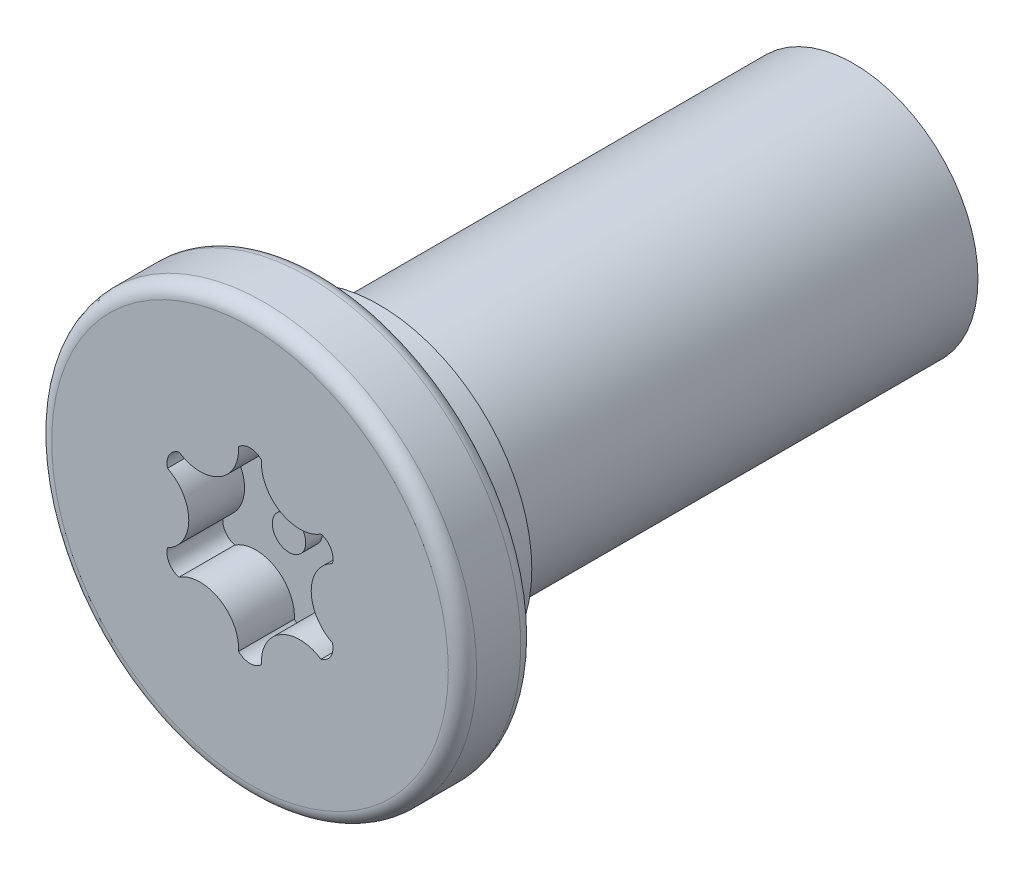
from build123d import *

# Parameters (mm, degrees)
SKETCH2_W           = 1.3
SKETCH2_H           = 3.81
SKETCH2_W_2         = 12.7
SKETCH2_H_2         = 2.23
CUT_EXTRUDE3_DEPTH  = 1
FILLET12_R          = 0.254
CUT_EXTRUDE6_START  = -12.7
SKETCH7_R           = 2.23
CUT_EXTRUDE6_DEPTH  = 12.7
SKETCH11_R          = 2.738000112
SKETCH11_R_2        = 2.230000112
BOSS_EXTRUDE1_DEPTH = 1.016
SKETCH12_R          = 2.230000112
BOSS_EXTRUDE2_DEPTH = 12.7
SKETCH14_R          = 0.3
BOSS_EXTRUDE4_DEPTH = 0.3
CUT_EXTRUDE7_START  = -12.7
SKETCH15_R          = 2.230000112
CUT_EXTRUDE7_DEPTH  = 12.7
SKETCH16_R          = 2.230000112
BOSS_EXTRUDE5_DEPTH = 9.525


with BuildPart() as part:
    # Sketch2 → Revolve1 (revolve)
    with BuildSketch(Plane(origin=(0, 0, 0), x_dir=(0, 0, -1), z_dir=(1, 0, 0)), mode=Mode.PRIVATE) as revolve1_sk:
        with Locations((0.65, 1.905)):
            Rectangle(SKETCH2_W, SKETCH2_H)
        with Locations((7.65, 1.115)):
            Rectangle(SKETCH2_W_2, SKETCH2_H_2)
    revolve(revolve1_sk.sketch.rotate(Axis((0, 0, -1.3), (0, 0, -1)), 90), axis=Axis((0, 0, -1.3), (0, 0, -1)))

    # Sketch3 → Cut-Extrude3 (cut)
    with BuildSketch(Plane.XY):
        with BuildLine():
            ThreePointArc((-0.205060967, 1.589373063), (0, 1.674312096), (0.205060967, 1.589373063))
            ThreePointArc((0.205060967, 1.589373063), (0.54882888, 0.950599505), (1.273906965, 0.972274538))
            ThreePointArc((1.273906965, 0.972274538), (1.449996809, 0.837156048), (1.478967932, 0.617098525))
            ThreePointArc((1.478967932, 0.617098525), (1.097657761, 0), (1.478967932, -0.617098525))
            ThreePointArc((1.478967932, -0.617098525), (1.449996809, -0.837156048), (1.273906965, -0.972274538))
            ThreePointArc((1.273906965, -0.972274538), (0.54882888, -0.950599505), (0.205060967, -1.589373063))
            ThreePointArc((0.205060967, -1.589373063), (0, -1.674312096), (-0.205060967, -1.589373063))
            ThreePointArc((-0.205060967, -1.589373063), (-0.54882888, -0.950599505), (-1.273906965, -0.972274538))
            ThreePointArc((-1.273906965, -0.972274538), (-1.449996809, -0.837156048), (-1.478967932, -0.617098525))
            ThreePointArc((-1.478967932, -0.617098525), (-1.097657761, 0), (-1.478967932, 0.617098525))
            ThreePointArc((-1.478967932, 0.617098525), (-1.449996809, 0.837156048), (-1.273906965, 0.972274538))
            ThreePointArc((-1.273906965, 0.972274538), (-0.54882888, 0.950599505), (-0.205060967, 1.589373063))
        make_face()
    extrude(amount=-CUT_EXTRUDE3_DEPTH, mode=Mode.SUBTRACT)

    # Fillet12
    fillet12_edges = [part.edges().sort_by_distance(p)[0] for p in [
        (-3.81, 0, 0),
        (-3.81, 0, -1.3),
    ]]
    fillet(fillet12_edges, radius=FILLET12_R)

    # Sketch7 → Cut-Extrude6 (cut)
    with BuildSketch(Plane(origin=(0, 0, -14), x_dir=(-1, 0, 0), z_dir=(0, 0, -1)).offset(CUT_EXTRUDE6_START)):
        Circle(SKETCH7_R)
    extrude(amount=CUT_EXTRUDE6_DEPTH, mode=Mode.SUBTRACT)

    # Sketch11 → Boss-Extrude1 (add)
    with BuildSketch(Plane(origin=(0, 0, -1.3), x_dir=(-1, 0, 0), z_dir=(0, 0, -1))):
        with Locations(Location((0, 0, 0), (0, 0, 180))):
            Circle(SKETCH11_R)
        Circle(SKETCH11_R_2, mode=Mode.SUBTRACT)
    extrude(amount=BOSS_EXTRUDE1_DEPTH)

    # Sketch12 → Boss-Extrude2 (add)
    with BuildSketch(Plane(origin=(0, 0, -1.3), x_dir=(-1, 0, 0), z_dir=(0, 0, -1))):
        Circle(SKETCH12_R)
    extrude(amount=BOSS_EXTRUDE2_DEPTH)

    # Sketch14 → Boss-Extrude4 (add)
    with BuildSketch(Plane.XY.offset(-1)):
        Circle(SKETCH14_R)
    extrude(amount=BOSS_EXTRUDE4_DEPTH)

    # Sketch15 → Cut-Extrude7 (cut)
    with BuildSketch(Plane(origin=(0, 0, -14), x_dir=(-1, 0, 0), z_dir=(0, 0, -1)).offset(CUT_EXTRUDE7_START)):
        Circle(SKETCH15_R)
    extrude(amount=CUT_EXTRUDE7_DEPTH, mode=Mode.SUBTRACT)

    # Sketch16 → Boss-Extrude5 (add)
    with BuildSketch(Plane(origin=(0, 0, -1.3), x_dir=(-1, 0, 0), z_dir=(0, 0, -1))):
        with Locations(Location((0, 0, 0), (0, 0, 180))):
            Circle(SKETCH16_R)
    extrude(amount=BOSS_EXTRUDE5_DEPTH)


solid = part.part
